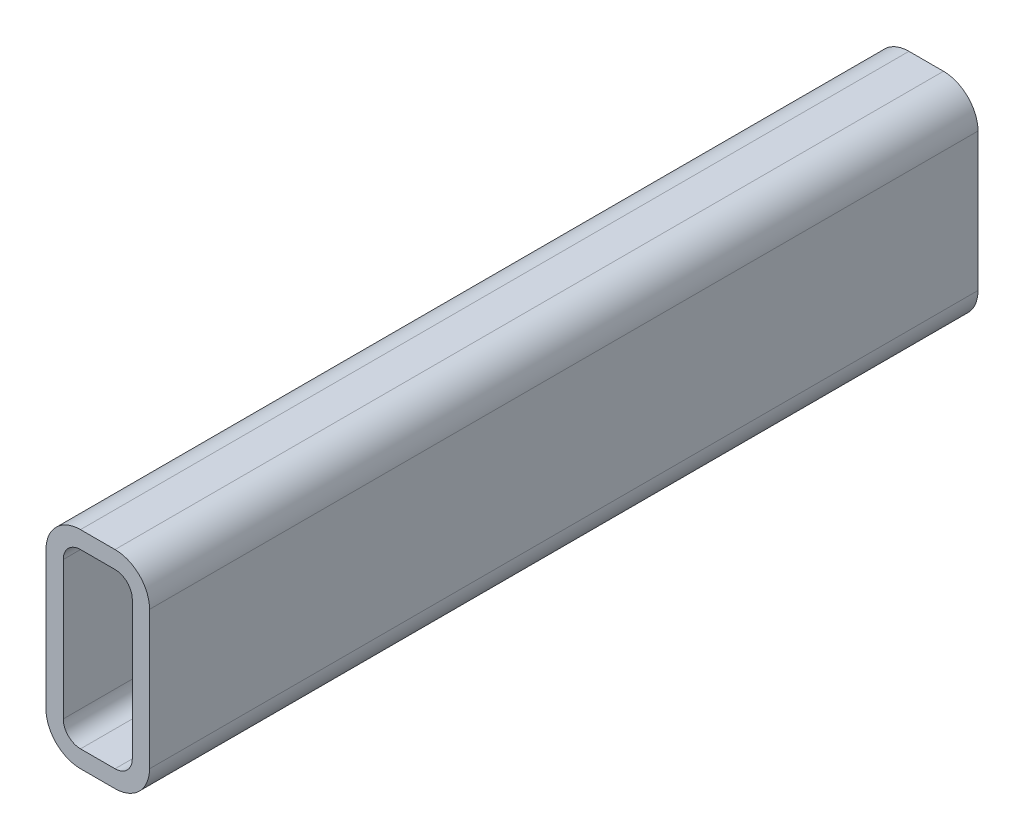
ISO-10303-21;
HEADER;
FILE_DESCRIPTION(('STEP AP214'),'2;1');
FILE_NAME('part.step','',(''),(''),'','','');
FILE_SCHEMA(('AUTOMOTIVE_DESIGN { 1 0 10303 214 1 1 1 1 }'));
ENDSEC;
DATA;
#1=APPLICATION_CONTEXT('core data for automotive mechanical design processes');
#2=APPLICATION_PROTOCOL_DEFINITION('international standard','automotive_design',2000,#1);
#3=PRODUCT_CONTEXT('',#1,'mechanical');
#4=PRODUCT('Part','Part','',(#3));
#5=PRODUCT_RELATED_PRODUCT_CATEGORY('part','',(#4));
#6=PRODUCT_DEFINITION_FORMATION('','',#4);
#7=PRODUCT_DEFINITION_CONTEXT('part definition',#1,'design');
#8=PRODUCT_DEFINITION('design','',#6,#7);
#9=PRODUCT_DEFINITION_SHAPE('','',#8);
#10=(LENGTH_UNIT() NAMED_UNIT(*) SI_UNIT(.MILLI.,.METRE.));
#11=(NAMED_UNIT(*) PLANE_ANGLE_UNIT() SI_UNIT($,.RADIAN.));
#12=(NAMED_UNIT(*) SI_UNIT($,.STERADIAN.) SOLID_ANGLE_UNIT());
#13=UNCERTAINTY_MEASURE_WITH_UNIT(LENGTH_MEASURE(1.E-05),#10,'distance_accuracy_value','');
#14=(GEOMETRIC_REPRESENTATION_CONTEXT(3) GLOBAL_UNCERTAINTY_ASSIGNED_CONTEXT((#13)) GLOBAL_UNIT_ASSIGNED_CONTEXT((#10,
#11,#12)) REPRESENTATION_CONTEXT('',''));
#15=CARTESIAN_POINT('',(0.,0.,0.));
#16=DIRECTION('',(0.,0.,1.));
#17=DIRECTION('',(1.,0.,0.));
#18=AXIS2_PLACEMENT_3D('',#15,#16,#17);
#19=CARTESIAN_POINT('',(12.7,63.5,304.8));
#20=DIRECTION('',(0.,0.,1.));
#21=DIRECTION('',(1.,0.,0.));
#22=AXIS2_PLACEMENT_3D('',#19,#20,#21);
#23=PLANE('',#22);
#24=CARTESIAN_POINT('',(12.7,63.5,304.8));
#25=DIRECTION('',(0.,0.,1.));
#26=DIRECTION('',(1.,0.,0.));
#27=AXIS2_PLACEMENT_3D('',#24,#25,#26);
#28=CIRCLE('',#27,12.7);
#29=CARTESIAN_POINT('',(12.7,76.2,304.8));
#30=VERTEX_POINT('',#29);
#31=CARTESIAN_POINT('',(0.,63.5,304.8));
#32=VERTEX_POINT('',#31);
#33=EDGE_CURVE('E211',#30,#32,#28,.T.);
#34=ORIENTED_EDGE('',*,*,#33,.T.);
#35=DIRECTION('',(0.,-1.,0.));
#36=VECTOR('',#35,1.);
#37=CARTESIAN_POINT('',(0.,12.7,304.8));
#38=LINE('',#37,#36);
#39=CARTESIAN_POINT('',(0.,12.7,304.8));
#40=VERTEX_POINT('',#39);
#41=EDGE_CURVE('E214',#32,#40,#38,.T.);
#42=ORIENTED_EDGE('',*,*,#41,.T.);
#43=CARTESIAN_POINT('',(12.7,12.7,304.8));
#44=DIRECTION('',(0.,0.,1.));
#45=DIRECTION('',(1.,0.,0.));
#46=AXIS2_PLACEMENT_3D('',#43,#44,#45);
#47=CIRCLE('',#46,12.7);
#48=CARTESIAN_POINT('',(12.7,0.,304.8));
#49=VERTEX_POINT('',#48);
#50=EDGE_CURVE('E217',#40,#49,#47,.T.);
#51=ORIENTED_EDGE('',*,*,#50,.T.);
#52=DIRECTION('',(1.,0.,0.));
#53=VECTOR('',#52,1.);
#54=CARTESIAN_POINT('',(25.4,0.,304.8));
#55=LINE('',#54,#53);
#56=CARTESIAN_POINT('',(25.4,0.,304.8));
#57=VERTEX_POINT('',#56);
#58=EDGE_CURVE('E219',#49,#57,#55,.T.);
#59=ORIENTED_EDGE('',*,*,#58,.T.);
#60=CARTESIAN_POINT('',(25.4,12.7,304.8));
#61=DIRECTION('',(0.,0.,1.));
#62=DIRECTION('',(1.,0.,0.));
#63=AXIS2_PLACEMENT_3D('',#60,#61,#62);
#64=CIRCLE('',#63,12.7);
#65=CARTESIAN_POINT('',(38.1,12.7,304.8));
#66=VERTEX_POINT('',#65);
#67=EDGE_CURVE('E221',#57,#66,#64,.T.);
#68=ORIENTED_EDGE('',*,*,#67,.T.);
#69=DIRECTION('',(0.,1.,0.));
#70=VECTOR('',#69,1.);
#71=CARTESIAN_POINT('',(38.1,63.5,304.8));
#72=LINE('',#71,#70);
#73=CARTESIAN_POINT('',(38.1,63.5,304.8));
#74=VERTEX_POINT('',#73);
#75=EDGE_CURVE('E223',#66,#74,#72,.T.);
#76=ORIENTED_EDGE('',*,*,#75,.T.);
#77=CARTESIAN_POINT('',(25.4,63.5,304.8));
#78=DIRECTION('',(0.,0.,1.));
#79=DIRECTION('',(1.,0.,0.));
#80=AXIS2_PLACEMENT_3D('',#77,#78,#79);
#81=CIRCLE('',#80,12.7);
#82=CARTESIAN_POINT('',(25.4,76.2,304.8));
#83=VERTEX_POINT('',#82);
#84=EDGE_CURVE('E225',#74,#83,#81,.T.);
#85=ORIENTED_EDGE('',*,*,#84,.T.);
#86=DIRECTION('',(-1.,0.,0.));
#87=VECTOR('',#86,1.);
#88=CARTESIAN_POINT('',(12.7,76.2,304.8));
#89=LINE('',#88,#87);
#90=EDGE_CURVE('E227',#83,#30,#89,.T.);
#91=ORIENTED_EDGE('',*,*,#90,.T.);
#92=EDGE_LOOP('',(#34,#42,#51,#59,#68,#76,#85,#91));
#93=FACE_BOUND('',#92,.T.);
#94=DIRECTION('',(0.,-1.,0.));
#95=VECTOR('',#94,1.);
#96=CARTESIAN_POINT('',(6.35,12.7,304.8));
#97=LINE('',#96,#95);
#98=CARTESIAN_POINT('',(6.35,63.5,304.8));
#99=VERTEX_POINT('',#98);
#100=CARTESIAN_POINT('',(6.35,12.7,304.8));
#101=VERTEX_POINT('',#100);
#102=EDGE_CURVE('E154',#99,#101,#97,.T.);
#103=ORIENTED_EDGE('',*,*,#102,.F.);
#104=CARTESIAN_POINT('',(12.7,63.5,304.8));
#105=DIRECTION('',(0.,0.,1.));
#106=DIRECTION('',(1.,0.,0.));
#107=AXIS2_PLACEMENT_3D('',#104,#105,#106);
#108=CIRCLE('',#107,6.35);
#109=CARTESIAN_POINT('',(12.7,69.85,304.8));
#110=VERTEX_POINT('',#109);
#111=EDGE_CURVE('E146',#110,#99,#108,.T.);
#112=ORIENTED_EDGE('',*,*,#111,.F.);
#113=DIRECTION('',(-1.,0.,0.));
#114=VECTOR('',#113,1.);
#115=CARTESIAN_POINT('',(12.7,69.85,304.8));
#116=LINE('',#115,#114);
#117=CARTESIAN_POINT('',(25.4,69.85,304.8));
#118=VERTEX_POINT('',#117);
#119=EDGE_CURVE('E179',#118,#110,#116,.T.);
#120=ORIENTED_EDGE('',*,*,#119,.F.);
#121=CARTESIAN_POINT('',(25.4,63.5,304.8));
#122=DIRECTION('',(0.,0.,1.));
#123=DIRECTION('',(1.,0.,0.));
#124=AXIS2_PLACEMENT_3D('',#121,#122,#123);
#125=CIRCLE('',#124,6.35);
#126=CARTESIAN_POINT('',(31.75,63.5,304.8));
#127=VERTEX_POINT('',#126);
#128=EDGE_CURVE('E177',#127,#118,#125,.T.);
#129=ORIENTED_EDGE('',*,*,#128,.F.);
#130=DIRECTION('',(0.,1.,0.));
#131=VECTOR('',#130,1.);
#132=CARTESIAN_POINT('',(31.75,63.5,304.8));
#133=LINE('',#132,#131);
#134=CARTESIAN_POINT('',(31.75,12.7,304.8));
#135=VERTEX_POINT('',#134);
#136=EDGE_CURVE('E175',#135,#127,#133,.T.);
#137=ORIENTED_EDGE('',*,*,#136,.F.);
#138=CARTESIAN_POINT('',(25.4,12.7,304.8));
#139=DIRECTION('',(0.,0.,1.));
#140=DIRECTION('',(1.,0.,0.));
#141=AXIS2_PLACEMENT_3D('',#138,#139,#140);
#142=CIRCLE('',#141,6.35);
#143=CARTESIAN_POINT('',(25.4,6.35000000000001,304.8));
#144=VERTEX_POINT('',#143);
#145=EDGE_CURVE('E173',#144,#135,#142,.T.);
#146=ORIENTED_EDGE('',*,*,#145,.F.);
#147=DIRECTION('',(1.,0.,0.));
#148=VECTOR('',#147,1.);
#149=CARTESIAN_POINT('',(25.4,6.35000000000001,304.8));
#150=LINE('',#149,#148);
#151=CARTESIAN_POINT('',(12.7,6.35000000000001,304.8));
#152=VERTEX_POINT('',#151);
#153=EDGE_CURVE('E169',#152,#144,#150,.T.);
#154=ORIENTED_EDGE('',*,*,#153,.F.);
#155=CARTESIAN_POINT('',(12.7,12.7,304.8));
#156=DIRECTION('',(0.,0.,1.));
#157=DIRECTION('',(1.,0.,0.));
#158=AXIS2_PLACEMENT_3D('',#155,#156,#157);
#159=CIRCLE('',#158,6.35);
#160=EDGE_CURVE('E167',#101,#152,#159,.T.);
#161=ORIENTED_EDGE('',*,*,#160,.F.);
#162=EDGE_LOOP('',(#103,#112,#120,#129,#137,#146,#154,#161));
#163=FACE_BOUND('',#162,.T.);
#164=ADVANCED_FACE('F33',(#93,#163),#23,.T.);
#165=CARTESIAN_POINT('',(12.7,63.5,0.));
#166=DIRECTION('',(0.,0.,1.));
#167=DIRECTION('',(1.,0.,0.));
#168=AXIS2_PLACEMENT_3D('',#165,#166,#167);
#169=PLANE('',#168);
#170=CARTESIAN_POINT('',(12.7,63.5,0.));
#171=DIRECTION('',(0.,0.,1.));
#172=DIRECTION('',(1.,0.,0.));
#173=AXIS2_PLACEMENT_3D('',#170,#171,#172);
#174=CIRCLE('',#173,12.7);
#175=CARTESIAN_POINT('',(12.7,76.2,0.));
#176=VERTEX_POINT('',#175);
#177=CARTESIAN_POINT('',(0.,63.5,0.));
#178=VERTEX_POINT('',#177);
#179=EDGE_CURVE('E162',#176,#178,#174,.T.);
#180=ORIENTED_EDGE('',*,*,#179,.F.);
#181=DIRECTION('',(-1.,0.,0.));
#182=VECTOR('',#181,1.);
#183=CARTESIAN_POINT('',(12.7,76.2,0.));
#184=LINE('',#183,#182);
#185=CARTESIAN_POINT('',(25.4,76.2,0.));
#186=VERTEX_POINT('',#185);
#187=EDGE_CURVE('E215',#186,#176,#184,.T.);
#188=ORIENTED_EDGE('',*,*,#187,.F.);
#189=CARTESIAN_POINT('',(25.4,63.5,0.));
#190=DIRECTION('',(0.,0.,1.));
#191=DIRECTION('',(1.,0.,0.));
#192=AXIS2_PLACEMENT_3D('',#189,#190,#191);
#193=CIRCLE('',#192,12.7);
#194=CARTESIAN_POINT('',(38.1,63.5,0.));
#195=VERTEX_POINT('',#194);
#196=EDGE_CURVE('E242',#195,#186,#193,.T.);
#197=ORIENTED_EDGE('',*,*,#196,.F.);
#198=DIRECTION('',(0.,1.,0.));
#199=VECTOR('',#198,1.);
#200=CARTESIAN_POINT('',(38.1,63.5,0.));
#201=LINE('',#200,#199);
#202=CARTESIAN_POINT('',(38.1,12.7,0.));
#203=VERTEX_POINT('',#202);
#204=EDGE_CURVE('E240',#203,#195,#201,.T.);
#205=ORIENTED_EDGE('',*,*,#204,.F.);
#206=CARTESIAN_POINT('',(25.4,12.7,0.));
#207=DIRECTION('',(0.,0.,1.));
#208=DIRECTION('',(1.,0.,0.));
#209=AXIS2_PLACEMENT_3D('',#206,#207,#208);
#210=CIRCLE('',#209,12.7);
#211=CARTESIAN_POINT('',(25.4,0.,0.));
#212=VERTEX_POINT('',#211);
#213=EDGE_CURVE('E238',#212,#203,#210,.T.);
#214=ORIENTED_EDGE('',*,*,#213,.F.);
#215=DIRECTION('',(1.,0.,0.));
#216=VECTOR('',#215,1.);
#217=CARTESIAN_POINT('',(25.4,0.,0.));
#218=LINE('',#217,#216);
#219=CARTESIAN_POINT('',(12.7,0.,0.));
#220=VERTEX_POINT('',#219);
#221=EDGE_CURVE('E236',#220,#212,#218,.T.);
#222=ORIENTED_EDGE('',*,*,#221,.F.);
#223=CARTESIAN_POINT('',(12.7,12.7,0.));
#224=DIRECTION('',(0.,0.,1.));
#225=DIRECTION('',(1.,0.,0.));
#226=AXIS2_PLACEMENT_3D('',#223,#224,#225);
#227=CIRCLE('',#226,12.7);
#228=CARTESIAN_POINT('',(0.,12.7,0.));
#229=VERTEX_POINT('',#228);
#230=EDGE_CURVE('E234',#229,#220,#227,.T.);
#231=ORIENTED_EDGE('',*,*,#230,.F.);
#232=DIRECTION('',(0.,-1.,0.));
#233=VECTOR('',#232,1.);
#234=CARTESIAN_POINT('',(0.,12.7,0.));
#235=LINE('',#234,#233);
#236=EDGE_CURVE('E232',#178,#229,#235,.T.);
#237=ORIENTED_EDGE('',*,*,#236,.F.);
#238=EDGE_LOOP('',(#180,#188,#197,#205,#214,#222,#231,#237));
#239=FACE_BOUND('',#238,.T.);
#240=CARTESIAN_POINT('',(12.7,63.5,0.));
#241=DIRECTION('',(0.,0.,1.));
#242=DIRECTION('',(1.,0.,0.));
#243=AXIS2_PLACEMENT_3D('',#240,#241,#242);
#244=CIRCLE('',#243,6.35);
#245=CARTESIAN_POINT('',(12.7,69.85,0.));
#246=VERTEX_POINT('',#245);
#247=CARTESIAN_POINT('',(6.35,63.5,0.));
#248=VERTEX_POINT('',#247);
#249=EDGE_CURVE('E56',#246,#248,#244,.T.);
#250=ORIENTED_EDGE('',*,*,#249,.T.);
#251=DIRECTION('',(0.,-1.,0.));
#252=VECTOR('',#251,1.);
#253=CARTESIAN_POINT('',(6.35,12.7,0.));
#254=LINE('',#253,#252);
#255=CARTESIAN_POINT('',(6.35,12.7,0.));
#256=VERTEX_POINT('',#255);
#257=EDGE_CURVE('E161',#248,#256,#254,.T.);
#258=ORIENTED_EDGE('',*,*,#257,.T.);
#259=CARTESIAN_POINT('',(12.7,12.7,0.));
#260=DIRECTION('',(0.,0.,1.));
#261=DIRECTION('',(1.,0.,0.));
#262=AXIS2_PLACEMENT_3D('',#259,#260,#261);
#263=CIRCLE('',#262,6.35);
#264=CARTESIAN_POINT('',(12.7,6.35000000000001,0.));
#265=VERTEX_POINT('',#264);
#266=EDGE_CURVE('E183',#256,#265,#263,.T.);
#267=ORIENTED_EDGE('',*,*,#266,.T.);
#268=DIRECTION('',(1.,0.,0.));
#269=VECTOR('',#268,1.);
#270=CARTESIAN_POINT('',(25.4,6.35000000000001,0.));
#271=LINE('',#270,#269);
#272=CARTESIAN_POINT('',(25.4,6.35000000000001,0.));
#273=VERTEX_POINT('',#272);
#274=EDGE_CURVE('E186',#265,#273,#271,.T.);
#275=ORIENTED_EDGE('',*,*,#274,.T.);
#276=CARTESIAN_POINT('',(25.4,12.7,0.));
#277=DIRECTION('',(0.,0.,1.));
#278=DIRECTION('',(1.,0.,0.));
#279=AXIS2_PLACEMENT_3D('',#276,#277,#278);
#280=CIRCLE('',#279,6.35);
#281=CARTESIAN_POINT('',(31.75,12.7,0.));
#282=VERTEX_POINT('',#281);
#283=EDGE_CURVE('E189',#273,#282,#280,.T.);
#284=ORIENTED_EDGE('',*,*,#283,.T.);
#285=DIRECTION('',(0.,1.,0.));
#286=VECTOR('',#285,1.);
#287=CARTESIAN_POINT('',(31.75,63.5,0.));
#288=LINE('',#287,#286);
#289=CARTESIAN_POINT('',(31.75,63.5,0.));
#290=VERTEX_POINT('',#289);
#291=EDGE_CURVE('E192',#282,#290,#288,.T.);
#292=ORIENTED_EDGE('',*,*,#291,.T.);
#293=CARTESIAN_POINT('',(25.4,63.5,0.));
#294=DIRECTION('',(0.,0.,1.));
#295=DIRECTION('',(1.,0.,0.));
#296=AXIS2_PLACEMENT_3D('',#293,#294,#295);
#297=CIRCLE('',#296,6.35);
#298=CARTESIAN_POINT('',(25.4,69.85,0.));
#299=VERTEX_POINT('',#298);
#300=EDGE_CURVE('E195',#290,#299,#297,.T.);
#301=ORIENTED_EDGE('',*,*,#300,.T.);
#302=DIRECTION('',(-1.,0.,0.));
#303=VECTOR('',#302,1.);
#304=CARTESIAN_POINT('',(12.7,69.85,0.));
#305=LINE('',#304,#303);
#306=EDGE_CURVE('E155',#299,#246,#305,.T.);
#307=ORIENTED_EDGE('',*,*,#306,.T.);
#308=EDGE_LOOP('',(#250,#258,#267,#275,#284,#292,#301,#307));
#309=FACE_BOUND('',#308,.T.);
#310=ADVANCED_FACE('F272',(#239,#309),#169,.F.);
#311=CARTESIAN_POINT('',(12.7,63.5,304.8));
#312=DIRECTION('',(0.,0.,-1.));
#313=DIRECTION('',(-1.,0.,0.));
#314=AXIS2_PLACEMENT_3D('',#311,#312,#313);
#315=CYLINDRICAL_SURFACE('',#314,12.7);
#316=ORIENTED_EDGE('',*,*,#179,.T.);
#317=DIRECTION('',(0.,0.,-1.));
#318=VECTOR('',#317,1.);
#319=CARTESIAN_POINT('',(0.,63.5,304.8));
#320=LINE('',#319,#318);
#321=EDGE_CURVE('E11',#32,#178,#320,.T.);
#322=ORIENTED_EDGE('',*,*,#321,.F.);
#323=ORIENTED_EDGE('',*,*,#33,.F.);
#324=DIRECTION('',(0.,0.,-1.));
#325=VECTOR('',#324,1.);
#326=CARTESIAN_POINT('',(12.7,76.2,304.8));
#327=LINE('',#326,#325);
#328=EDGE_CURVE('E229',#30,#176,#327,.T.);
#329=ORIENTED_EDGE('',*,*,#328,.T.);
#330=EDGE_LOOP('',(#316,#322,#323,#329));
#331=FACE_BOUND('',#330,.T.);
#332=ADVANCED_FACE('F35',(#331),#315,.T.);
#333=CARTESIAN_POINT('',(0.,12.7,304.8));
#334=DIRECTION('',(1.,0.,0.));
#335=DIRECTION('',(0.,0.,-1.));
#336=AXIS2_PLACEMENT_3D('',#333,#334,#335);
#337=PLANE('',#336);
#338=ORIENTED_EDGE('',*,*,#236,.T.);
#339=DIRECTION('',(0.,0.,-1.));
#340=VECTOR('',#339,1.);
#341=CARTESIAN_POINT('',(0.,12.7,304.8));
#342=LINE('',#341,#340);
#343=EDGE_CURVE('E41',#40,#229,#342,.T.);
#344=ORIENTED_EDGE('',*,*,#343,.F.);
#345=ORIENTED_EDGE('',*,*,#41,.F.);
#346=ORIENTED_EDGE('',*,*,#321,.T.);
#347=EDGE_LOOP('',(#338,#344,#345,#346));
#348=FACE_BOUND('',#347,.T.);
#349=ADVANCED_FACE('F289',(#348),#337,.F.);
#350=CARTESIAN_POINT('',(12.7,12.7,304.8));
#351=DIRECTION('',(0.,0.,-1.));
#352=DIRECTION('',(-1.,0.,0.));
#353=AXIS2_PLACEMENT_3D('',#350,#351,#352);
#354=CYLINDRICAL_SURFACE('',#353,12.7);
#355=ORIENTED_EDGE('',*,*,#230,.T.);
#356=DIRECTION('',(0.,0.,-1.));
#357=VECTOR('',#356,1.);
#358=CARTESIAN_POINT('',(12.7,0.,304.8));
#359=LINE('',#358,#357);
#360=EDGE_CURVE('E259',#49,#220,#359,.T.);
#361=ORIENTED_EDGE('',*,*,#360,.F.);
#362=ORIENTED_EDGE('',*,*,#50,.F.);
#363=ORIENTED_EDGE('',*,*,#343,.T.);
#364=EDGE_LOOP('',(#355,#361,#362,#363));
#365=FACE_BOUND('',#364,.T.);
#366=ADVANCED_FACE('F266',(#365),#354,.T.);
#367=CARTESIAN_POINT('',(25.4,0.,304.8));
#368=DIRECTION('',(0.,1.,0.));
#369=DIRECTION('',(0.,0.,1.));
#370=AXIS2_PLACEMENT_3D('',#367,#368,#369);
#371=PLANE('',#370);
#372=ORIENTED_EDGE('',*,*,#221,.T.);
#373=DIRECTION('',(0.,0.,-1.));
#374=VECTOR('',#373,1.);
#375=CARTESIAN_POINT('',(25.4,0.,304.8));
#376=LINE('',#375,#374);
#377=EDGE_CURVE('E256',#57,#212,#376,.T.);
#378=ORIENTED_EDGE('',*,*,#377,.F.);
#379=ORIENTED_EDGE('',*,*,#58,.F.);
#380=ORIENTED_EDGE('',*,*,#360,.T.);
#381=EDGE_LOOP('',(#372,#378,#379,#380));
#382=FACE_BOUND('',#381,.T.);
#383=ADVANCED_FACE('F278',(#382),#371,.F.);
#384=CARTESIAN_POINT('',(25.4,12.7,304.8));
#385=DIRECTION('',(0.,0.,-1.));
#386=DIRECTION('',(-1.,0.,0.));
#387=AXIS2_PLACEMENT_3D('',#384,#385,#386);
#388=CYLINDRICAL_SURFACE('',#387,12.7);
#389=ORIENTED_EDGE('',*,*,#213,.T.);
#390=DIRECTION('',(0.,0.,-1.));
#391=VECTOR('',#390,1.);
#392=CARTESIAN_POINT('',(38.1,12.7,304.8));
#393=LINE('',#392,#391);
#394=EDGE_CURVE('E253',#66,#203,#393,.T.);
#395=ORIENTED_EDGE('',*,*,#394,.F.);
#396=ORIENTED_EDGE('',*,*,#67,.F.);
#397=ORIENTED_EDGE('',*,*,#377,.T.);
#398=EDGE_LOOP('',(#389,#395,#396,#397));
#399=FACE_BOUND('',#398,.T.);
#400=ADVANCED_FACE('F282',(#399),#388,.T.);
#401=CARTESIAN_POINT('',(38.1,63.5,304.8));
#402=DIRECTION('',(-1.,0.,0.));
#403=DIRECTION('',(0.,0.,1.));
#404=AXIS2_PLACEMENT_3D('',#401,#402,#403);
#405=PLANE('',#404);
#406=ORIENTED_EDGE('',*,*,#204,.T.);
#407=DIRECTION('',(0.,0.,-1.));
#408=VECTOR('',#407,1.);
#409=CARTESIAN_POINT('',(38.1,63.5,304.8));
#410=LINE('',#409,#408);
#411=EDGE_CURVE('E250',#74,#195,#410,.T.);
#412=ORIENTED_EDGE('',*,*,#411,.F.);
#413=ORIENTED_EDGE('',*,*,#75,.F.);
#414=ORIENTED_EDGE('',*,*,#394,.T.);
#415=EDGE_LOOP('',(#406,#412,#413,#414));
#416=FACE_BOUND('',#415,.T.);
#417=ADVANCED_FACE('F302',(#416),#405,.F.);
#418=CARTESIAN_POINT('',(25.4,63.5,304.8));
#419=DIRECTION('',(0.,0.,-1.));
#420=DIRECTION('',(-1.,0.,0.));
#421=AXIS2_PLACEMENT_3D('',#418,#419,#420);
#422=CYLINDRICAL_SURFACE('',#421,12.7);
#423=ORIENTED_EDGE('',*,*,#196,.T.);
#424=DIRECTION('',(0.,0.,-1.));
#425=VECTOR('',#424,1.);
#426=CARTESIAN_POINT('',(25.4,76.2,304.8));
#427=LINE('',#426,#425);
#428=EDGE_CURVE('E247',#83,#186,#427,.T.);
#429=ORIENTED_EDGE('',*,*,#428,.F.);
#430=ORIENTED_EDGE('',*,*,#84,.F.);
#431=ORIENTED_EDGE('',*,*,#411,.T.);
#432=EDGE_LOOP('',(#423,#429,#430,#431));
#433=FACE_BOUND('',#432,.T.);
#434=ADVANCED_FACE('F300',(#433),#422,.T.);
#435=CARTESIAN_POINT('',(12.7,76.2,304.8));
#436=DIRECTION('',(0.,-1.,0.));
#437=DIRECTION('',(0.,0.,-1.));
#438=AXIS2_PLACEMENT_3D('',#435,#436,#437);
#439=PLANE('',#438);
#440=ORIENTED_EDGE('',*,*,#187,.T.);
#441=ORIENTED_EDGE('',*,*,#328,.F.);
#442=ORIENTED_EDGE('',*,*,#90,.F.);
#443=ORIENTED_EDGE('',*,*,#428,.T.);
#444=EDGE_LOOP('',(#440,#441,#442,#443));
#445=FACE_BOUND('',#444,.T.);
#446=ADVANCED_FACE('F295',(#445),#439,.F.);
#447=CARTESIAN_POINT('',(12.7,63.5,304.8));
#448=DIRECTION('',(0.,0.,-1.));
#449=DIRECTION('',(-1.,0.,0.));
#450=AXIS2_PLACEMENT_3D('',#447,#448,#449);
#451=CYLINDRICAL_SURFACE('',#450,6.35);
#452=ORIENTED_EDGE('',*,*,#249,.F.);
#453=DIRECTION('',(0.,0.,-1.));
#454=VECTOR('',#453,1.);
#455=CARTESIAN_POINT('',(12.7,69.85,304.8));
#456=LINE('',#455,#454);
#457=EDGE_CURVE('E150',#110,#246,#456,.T.);
#458=ORIENTED_EDGE('',*,*,#457,.F.);
#459=ORIENTED_EDGE('',*,*,#111,.T.);
#460=DIRECTION('',(0.,0.,-1.));
#461=VECTOR('',#460,1.);
#462=CARTESIAN_POINT('',(6.35,63.5,304.8));
#463=LINE('',#462,#461);
#464=EDGE_CURVE('E149',#99,#248,#463,.T.);
#465=ORIENTED_EDGE('',*,*,#464,.T.);
#466=EDGE_LOOP('',(#452,#458,#459,#465));
#467=FACE_BOUND('',#466,.T.);
#468=ADVANCED_FACE('F148',(#467),#451,.F.);
#469=CARTESIAN_POINT('',(6.35,12.7,304.8));
#470=DIRECTION('',(1.,0.,0.));
#471=DIRECTION('',(0.,0.,-1.));
#472=AXIS2_PLACEMENT_3D('',#469,#470,#471);
#473=PLANE('',#472);
#474=ORIENTED_EDGE('',*,*,#257,.F.);
#475=ORIENTED_EDGE('',*,*,#464,.F.);
#476=ORIENTED_EDGE('',*,*,#102,.T.);
#477=DIRECTION('',(0.,0.,-1.));
#478=VECTOR('',#477,1.);
#479=CARTESIAN_POINT('',(6.35,12.7,304.8));
#480=LINE('',#479,#478);
#481=EDGE_CURVE('E163',#101,#256,#480,.T.);
#482=ORIENTED_EDGE('',*,*,#481,.T.);
#483=EDGE_LOOP('',(#474,#475,#476,#482));
#484=FACE_BOUND('',#483,.T.);
#485=ADVANCED_FACE('F158',(#484),#473,.T.);
#486=CARTESIAN_POINT('',(12.7,12.7,304.8));
#487=DIRECTION('',(0.,0.,-1.));
#488=DIRECTION('',(-1.,0.,0.));
#489=AXIS2_PLACEMENT_3D('',#486,#487,#488);
#490=CYLINDRICAL_SURFACE('',#489,6.35);
#491=ORIENTED_EDGE('',*,*,#266,.F.);
#492=ORIENTED_EDGE('',*,*,#481,.F.);
#493=ORIENTED_EDGE('',*,*,#160,.T.);
#494=DIRECTION('',(0.,0.,-1.));
#495=VECTOR('',#494,1.);
#496=CARTESIAN_POINT('',(12.7,6.35000000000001,304.8));
#497=LINE('',#496,#495);
#498=EDGE_CURVE('E208',#152,#265,#497,.T.);
#499=ORIENTED_EDGE('',*,*,#498,.T.);
#500=EDGE_LOOP('',(#491,#492,#493,#499));
#501=FACE_BOUND('',#500,.T.);
#502=ADVANCED_FACE('F327',(#501),#490,.F.);
#503=CARTESIAN_POINT('',(25.4,6.35000000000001,304.8));
#504=DIRECTION('',(0.,1.,0.));
#505=DIRECTION('',(0.,0.,1.));
#506=AXIS2_PLACEMENT_3D('',#503,#504,#505);
#507=PLANE('',#506);
#508=ORIENTED_EDGE('',*,*,#274,.F.);
#509=ORIENTED_EDGE('',*,*,#498,.F.);
#510=ORIENTED_EDGE('',*,*,#153,.T.);
#511=DIRECTION('',(0.,0.,-1.));
#512=VECTOR('',#511,1.);
#513=CARTESIAN_POINT('',(25.4,6.35000000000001,304.8));
#514=LINE('',#513,#512);
#515=EDGE_CURVE('E206',#144,#273,#514,.T.);
#516=ORIENTED_EDGE('',*,*,#515,.T.);
#517=EDGE_LOOP('',(#508,#509,#510,#516));
#518=FACE_BOUND('',#517,.T.);
#519=ADVANCED_FACE('F331',(#518),#507,.T.);
#520=CARTESIAN_POINT('',(25.4,12.7,304.8));
#521=DIRECTION('',(0.,0.,-1.));
#522=DIRECTION('',(-1.,0.,0.));
#523=AXIS2_PLACEMENT_3D('',#520,#521,#522);
#524=CYLINDRICAL_SURFACE('',#523,6.35);
#525=ORIENTED_EDGE('',*,*,#283,.F.);
#526=ORIENTED_EDGE('',*,*,#515,.F.);
#527=ORIENTED_EDGE('',*,*,#145,.T.);
#528=DIRECTION('',(0.,0.,-1.));
#529=VECTOR('',#528,1.);
#530=CARTESIAN_POINT('',(31.75,12.7,304.8));
#531=LINE('',#530,#529);
#532=EDGE_CURVE('E204',#135,#282,#531,.T.);
#533=ORIENTED_EDGE('',*,*,#532,.T.);
#534=EDGE_LOOP('',(#525,#526,#527,#533));
#535=FACE_BOUND('',#534,.T.);
#536=ADVANCED_FACE('F337',(#535),#524,.F.);
#537=CARTESIAN_POINT('',(31.75,63.5,304.8));
#538=DIRECTION('',(-1.,0.,0.));
#539=DIRECTION('',(0.,0.,1.));
#540=AXIS2_PLACEMENT_3D('',#537,#538,#539);
#541=PLANE('',#540);
#542=ORIENTED_EDGE('',*,*,#291,.F.);
#543=ORIENTED_EDGE('',*,*,#532,.F.);
#544=ORIENTED_EDGE('',*,*,#136,.T.);
#545=DIRECTION('',(0.,0.,-1.));
#546=VECTOR('',#545,1.);
#547=CARTESIAN_POINT('',(31.75,63.5,304.8));
#548=LINE('',#547,#546);
#549=EDGE_CURVE('E202',#127,#290,#548,.T.);
#550=ORIENTED_EDGE('',*,*,#549,.T.);
#551=EDGE_LOOP('',(#542,#543,#544,#550));
#552=FACE_BOUND('',#551,.T.);
#553=ADVANCED_FACE('F341',(#552),#541,.T.);
#554=CARTESIAN_POINT('',(25.4,63.5,304.8));
#555=DIRECTION('',(0.,0.,-1.));
#556=DIRECTION('',(-1.,0.,0.));
#557=AXIS2_PLACEMENT_3D('',#554,#555,#556);
#558=CYLINDRICAL_SURFACE('',#557,6.35);
#559=ORIENTED_EDGE('',*,*,#300,.F.);
#560=ORIENTED_EDGE('',*,*,#549,.F.);
#561=ORIENTED_EDGE('',*,*,#128,.T.);
#562=DIRECTION('',(0.,0.,-1.));
#563=VECTOR('',#562,1.);
#564=CARTESIAN_POINT('',(25.4,69.85,304.8));
#565=LINE('',#564,#563);
#566=EDGE_CURVE('E48',#118,#299,#565,.T.);
#567=ORIENTED_EDGE('',*,*,#566,.T.);
#568=EDGE_LOOP('',(#559,#560,#561,#567));
#569=FACE_BOUND('',#568,.T.);
#570=ADVANCED_FACE('F345',(#569),#558,.F.);
#571=CARTESIAN_POINT('',(12.7,69.85,304.8));
#572=DIRECTION('',(0.,-1.,0.));
#573=DIRECTION('',(0.,0.,-1.));
#574=AXIS2_PLACEMENT_3D('',#571,#572,#573);
#575=PLANE('',#574);
#576=ORIENTED_EDGE('',*,*,#306,.F.);
#577=ORIENTED_EDGE('',*,*,#566,.F.);
#578=ORIENTED_EDGE('',*,*,#119,.T.);
#579=ORIENTED_EDGE('',*,*,#457,.T.);
#580=EDGE_LOOP('',(#576,#577,#578,#579));
#581=FACE_BOUND('',#580,.T.);
#582=ADVANCED_FACE('F349',(#581),#575,.T.);
#583=CLOSED_SHELL('',(#164,#310,#332,#349,#366,#383,#400,#417,#434,#446,#468,#485,#502,#519,
#536,#553,#570,#582));
#584=MANIFOLD_SOLID_BREP('B2',#583);
#585=ADVANCED_BREP_SHAPE_REPRESENTATION('',(#18,#584),#14);
#586=SHAPE_DEFINITION_REPRESENTATION(#9,#585);
ENDSEC;
END-ISO-10303-21;
